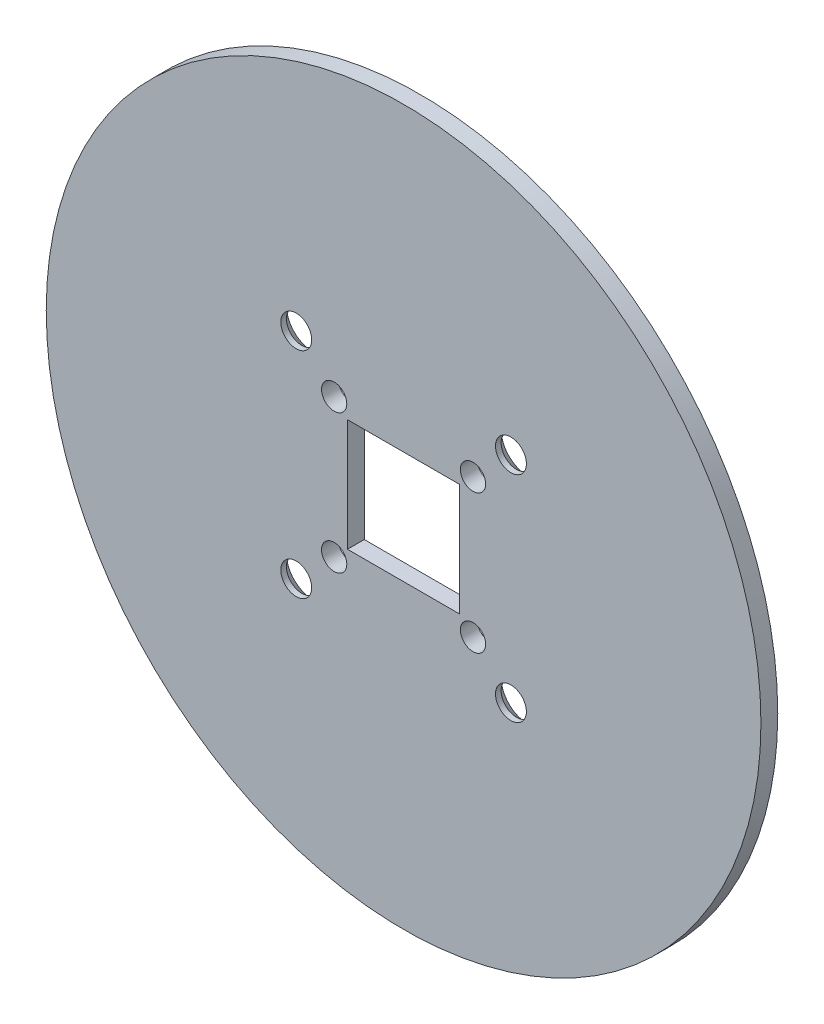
ISO-10303-21;
HEADER;
FILE_DESCRIPTION(('STEP AP214'),'2;1');
FILE_NAME('part.step','',(''),(''),'','','');
FILE_SCHEMA(('AUTOMOTIVE_DESIGN { 1 0 10303 214 1 1 1 1 }'));
ENDSEC;
DATA;
#1=APPLICATION_CONTEXT('core data for automotive mechanical design processes');
#2=APPLICATION_PROTOCOL_DEFINITION('international standard','automotive_design',2000,#1);
#3=PRODUCT_CONTEXT('',#1,'mechanical');
#4=PRODUCT('Part','Part','',(#3));
#5=PRODUCT_RELATED_PRODUCT_CATEGORY('part','',(#4));
#6=PRODUCT_DEFINITION_FORMATION('','',#4);
#7=PRODUCT_DEFINITION_CONTEXT('part definition',#1,'design');
#8=PRODUCT_DEFINITION('design','',#6,#7);
#9=PRODUCT_DEFINITION_SHAPE('','',#8);
#10=(LENGTH_UNIT() NAMED_UNIT(*) SI_UNIT(.MILLI.,.METRE.));
#11=(NAMED_UNIT(*) PLANE_ANGLE_UNIT() SI_UNIT($,.RADIAN.));
#12=(NAMED_UNIT(*) SI_UNIT($,.STERADIAN.) SOLID_ANGLE_UNIT());
#13=UNCERTAINTY_MEASURE_WITH_UNIT(LENGTH_MEASURE(1.E-05),#10,'distance_accuracy_value','');
#14=(GEOMETRIC_REPRESENTATION_CONTEXT(3) GLOBAL_UNCERTAINTY_ASSIGNED_CONTEXT((#13)) GLOBAL_UNIT_ASSIGNED_CONTEXT((#10,
#11,#12)) REPRESENTATION_CONTEXT('',''));
#15=CARTESIAN_POINT('',(0.,0.,0.));
#16=DIRECTION('',(0.,0.,1.));
#17=DIRECTION('',(1.,0.,0.));
#18=AXIS2_PLACEMENT_3D('',#15,#16,#17);
#19=CARTESIAN_POINT('',(-63.6939766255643,-63.6939766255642,3.));
#20=DIRECTION('',(0.,0.,1.));
#21=DIRECTION('',(1.,0.,0.));
#22=AXIS2_PLACEMENT_3D('',#19,#20,#21);
#23=PLANE('',#22);
#24=CARTESIAN_POINT('',(12.3743686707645,-12.3743686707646,3.));
#25=DIRECTION('',(0.,0.,1.));
#26=DIRECTION('',(1.,0.,0.));
#27=AXIS2_PLACEMENT_3D('',#24,#25,#26);
#28=CIRCLE('',#27,2.25);
#29=CARTESIAN_POINT('',(14.6243686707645,-12.3743686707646,3.));
#30=VERTEX_POINT('',#29);
#31=EDGE_CURVE('E170',#30,#30,#28,.T.);
#32=ORIENTED_EDGE('',*,*,#31,.F.);
#33=EDGE_LOOP('',(#32));
#34=FACE_BOUND('',#33,.T.);
#35=CARTESIAN_POINT('',(12.3743686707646,12.3743686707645,3.));
#36=DIRECTION('',(0.,0.,1.));
#37=DIRECTION('',(1.,0.,0.));
#38=AXIS2_PLACEMENT_3D('',#35,#36,#37);
#39=CIRCLE('',#38,2.25);
#40=CARTESIAN_POINT('',(14.6243686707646,12.3743686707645,3.));
#41=VERTEX_POINT('',#40);
#42=EDGE_CURVE('E176',#41,#41,#39,.T.);
#43=ORIENTED_EDGE('',*,*,#42,.F.);
#44=EDGE_LOOP('',(#43));
#45=FACE_BOUND('',#44,.T.);
#46=CARTESIAN_POINT('',(-12.3743686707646,-12.3743686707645,3.));
#47=DIRECTION('',(0.,0.,1.));
#48=DIRECTION('',(1.,0.,0.));
#49=AXIS2_PLACEMENT_3D('',#46,#47,#48);
#50=CIRCLE('',#49,2.25);
#51=CARTESIAN_POINT('',(-10.1243686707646,-12.3743686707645,3.));
#52=VERTEX_POINT('',#51);
#53=EDGE_CURVE('E182',#52,#52,#50,.T.);
#54=ORIENTED_EDGE('',*,*,#53,.F.);
#55=EDGE_LOOP('',(#54));
#56=FACE_BOUND('',#55,.T.);
#57=CARTESIAN_POINT('',(-12.3743686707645,12.3743686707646,3.));
#58=DIRECTION('',(0.,0.,1.));
#59=DIRECTION('',(1.,0.,0.));
#60=AXIS2_PLACEMENT_3D('',#57,#58,#59);
#61=CIRCLE('',#60,2.25);
#62=CARTESIAN_POINT('',(-10.1243686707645,12.3743686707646,3.));
#63=VERTEX_POINT('',#62);
#64=EDGE_CURVE('E188',#63,#63,#61,.T.);
#65=ORIENTED_EDGE('',*,*,#64,.F.);
#66=EDGE_LOOP('',(#65));
#67=FACE_BOUND('',#66,.T.);
#68=CARTESIAN_POINT('',(-19.1341716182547,-19.1341716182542,3.));
#69=DIRECTION('',(0.,0.,1.));
#70=DIRECTION('',(-1.,0.,0.));
#71=AXIS2_PLACEMENT_3D('',#68,#69,#70);
#72=CIRCLE('',#71,2.75);
#73=CARTESIAN_POINT('',(-21.8841716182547,-19.1341716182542,3.));
#74=VERTEX_POINT('',#73);
#75=EDGE_CURVE('E105',#74,#74,#72,.T.);
#76=ORIENTED_EDGE('',*,*,#75,.F.);
#77=EDGE_LOOP('',(#76));
#78=FACE_BOUND('',#77,.T.);
#79=CARTESIAN_POINT('',(19.1341716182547,-19.1341716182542,3.));
#80=DIRECTION('',(0.,0.,1.));
#81=DIRECTION('',(1.,0.,0.));
#82=AXIS2_PLACEMENT_3D('',#79,#80,#81);
#83=CIRCLE('',#82,2.75);
#84=CARTESIAN_POINT('',(21.8841716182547,-19.1341716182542,3.));
#85=VERTEX_POINT('',#84);
#86=EDGE_CURVE('E92',#85,#85,#83,.T.);
#87=ORIENTED_EDGE('',*,*,#86,.F.);
#88=EDGE_LOOP('',(#87));
#89=FACE_BOUND('',#88,.T.);
#90=CARTESIAN_POINT('',(19.1341716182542,19.1341716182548,3.));
#91=DIRECTION('',(0.,0.,1.));
#92=DIRECTION('',(1.,0.,0.));
#93=AXIS2_PLACEMENT_3D('',#90,#91,#92);
#94=CIRCLE('',#93,2.75);
#95=CARTESIAN_POINT('',(21.8841716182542,19.1341716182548,3.));
#96=VERTEX_POINT('',#95);
#97=EDGE_CURVE('E117',#96,#96,#94,.T.);
#98=ORIENTED_EDGE('',*,*,#97,.F.);
#99=EDGE_LOOP('',(#98));
#100=FACE_BOUND('',#99,.T.);
#101=DIRECTION('',(0.,1.,0.));
#102=VECTOR('',#101,1.);
#103=CARTESIAN_POINT('',(10.,10.,3.));
#104=LINE('',#103,#102);
#105=CARTESIAN_POINT('',(10.,-10.,3.));
#106=VERTEX_POINT('',#105);
#107=CARTESIAN_POINT('',(10.,10.,3.));
#108=VERTEX_POINT('',#107);
#109=EDGE_CURVE('E84',#106,#108,#104,.T.);
#110=ORIENTED_EDGE('',*,*,#109,.F.);
#111=DIRECTION('',(1.,0.,0.));
#112=VECTOR('',#111,1.);
#113=CARTESIAN_POINT('',(-9.99999999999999,-10.,3.));
#114=LINE('',#113,#112);
#115=CARTESIAN_POINT('',(-9.99999999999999,-10.,3.));
#116=VERTEX_POINT('',#115);
#117=EDGE_CURVE('E76',#116,#106,#114,.T.);
#118=ORIENTED_EDGE('',*,*,#117,.F.);
#119=DIRECTION('',(0.,-1.,0.));
#120=VECTOR('',#119,1.);
#121=CARTESIAN_POINT('',(-9.99999999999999,10.,3.));
#122=LINE('',#121,#120);
#123=CARTESIAN_POINT('',(-9.99999999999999,9.99999999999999,3.));
#124=VERTEX_POINT('',#123);
#125=EDGE_CURVE('E99',#124,#116,#122,.T.);
#126=ORIENTED_EDGE('',*,*,#125,.F.);
#127=DIRECTION('',(-1.,0.,0.));
#128=VECTOR('',#127,1.);
#129=CARTESIAN_POINT('',(-9.99999999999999,10.,3.));
#130=LINE('',#129,#128);
#131=EDGE_CURVE('E97',#108,#124,#130,.T.);
#132=ORIENTED_EDGE('',*,*,#131,.F.);
#133=EDGE_LOOP('',(#110,#118,#126,#132));
#134=FACE_BOUND('',#133,.T.);
#135=CARTESIAN_POINT('',(-19.1341716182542,19.1341716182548,3.));
#136=DIRECTION('',(0.,0.,1.));
#137=DIRECTION('',(-1.,0.,0.));
#138=AXIS2_PLACEMENT_3D('',#135,#136,#137);
#139=CIRCLE('',#138,2.75);
#140=CARTESIAN_POINT('',(-21.8841716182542,19.1341716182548,3.));
#141=VERTEX_POINT('',#140);
#142=EDGE_CURVE('E191',#141,#141,#139,.T.);
#143=ORIENTED_EDGE('',*,*,#142,.F.);
#144=EDGE_LOOP('',(#143));
#145=FACE_BOUND('',#144,.T.);
#146=CARTESIAN_POINT('',(0.,0.,3.));
#147=DIRECTION('',(0.,0.,1.));
#148=DIRECTION('',(1.,0.,0.));
#149=AXIS2_PLACEMENT_3D('',#146,#147,#148);
#150=CIRCLE('',#149,63.6939766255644);
#151=CARTESIAN_POINT('',(63.6939766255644,0.,3.));
#152=VERTEX_POINT('',#151);
#153=EDGE_CURVE('E162',#152,#152,#150,.T.);
#154=ORIENTED_EDGE('',*,*,#153,.T.);
#155=EDGE_LOOP('',(#154));
#156=FACE_BOUND('',#155,.T.);
#157=ADVANCED_FACE('F35',(#34,#45,#56,#67,#78,#89,#100,#134,#145,#156),#23,.T.);
#158=CARTESIAN_POINT('',(-63.6939766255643,-63.6939766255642,0.));
#159=DIRECTION('',(0.,0.,1.));
#160=DIRECTION('',(1.,0.,0.));
#161=AXIS2_PLACEMENT_3D('',#158,#159,#160);
#162=PLANE('',#161);
#163=CARTESIAN_POINT('',(12.3743686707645,-12.3743686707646,0.));
#164=DIRECTION('',(0.,0.,-1.));
#165=DIRECTION('',(-1.,0.,0.));
#166=AXIS2_PLACEMENT_3D('',#163,#164,#165);
#167=CIRCLE('',#166,2.25);
#168=CARTESIAN_POINT('',(10.1243686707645,-12.3743686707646,0.));
#169=VERTEX_POINT('',#168);
#170=EDGE_CURVE('E165',#169,#169,#167,.T.);
#171=ORIENTED_EDGE('',*,*,#170,.F.);
#172=EDGE_LOOP('',(#171));
#173=FACE_BOUND('',#172,.T.);
#174=CARTESIAN_POINT('',(12.3743686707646,12.3743686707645,0.));
#175=DIRECTION('',(0.,0.,-1.));
#176=DIRECTION('',(-1.,0.,0.));
#177=AXIS2_PLACEMENT_3D('',#174,#175,#176);
#178=CIRCLE('',#177,2.25);
#179=CARTESIAN_POINT('',(10.1243686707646,12.3743686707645,0.));
#180=VERTEX_POINT('',#179);
#181=EDGE_CURVE('E173',#180,#180,#178,.T.);
#182=ORIENTED_EDGE('',*,*,#181,.F.);
#183=EDGE_LOOP('',(#182));
#184=FACE_BOUND('',#183,.T.);
#185=CARTESIAN_POINT('',(-12.3743686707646,-12.3743686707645,0.));
#186=DIRECTION('',(0.,0.,-1.));
#187=DIRECTION('',(-1.,0.,0.));
#188=AXIS2_PLACEMENT_3D('',#185,#186,#187);
#189=CIRCLE('',#188,2.25);
#190=CARTESIAN_POINT('',(-14.6243686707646,-12.3743686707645,0.));
#191=VERTEX_POINT('',#190);
#192=EDGE_CURVE('E179',#191,#191,#189,.T.);
#193=ORIENTED_EDGE('',*,*,#192,.F.);
#194=EDGE_LOOP('',(#193));
#195=FACE_BOUND('',#194,.T.);
#196=CARTESIAN_POINT('',(-12.3743686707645,12.3743686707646,0.));
#197=DIRECTION('',(0.,0.,-1.));
#198=DIRECTION('',(-1.,0.,0.));
#199=AXIS2_PLACEMENT_3D('',#196,#197,#198);
#200=CIRCLE('',#199,2.25);
#201=CARTESIAN_POINT('',(-14.6243686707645,12.3743686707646,0.));
#202=VERTEX_POINT('',#201);
#203=EDGE_CURVE('E185',#202,#202,#200,.T.);
#204=ORIENTED_EDGE('',*,*,#203,.F.);
#205=EDGE_LOOP('',(#204));
#206=FACE_BOUND('',#205,.T.);
#207=CARTESIAN_POINT('',(19.1341716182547,-19.1341716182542,0.));
#208=DIRECTION('',(0.,0.,1.));
#209=DIRECTION('',(1.,0.,0.));
#210=AXIS2_PLACEMENT_3D('',#207,#208,#209);
#211=CIRCLE('',#210,4.74999999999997);
#212=CARTESIAN_POINT('',(23.8841716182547,-19.1341716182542,0.));
#213=VERTEX_POINT('',#212);
#214=EDGE_CURVE('E129',#213,#213,#211,.T.);
#215=ORIENTED_EDGE('',*,*,#214,.T.);
#216=EDGE_LOOP('',(#215));
#217=FACE_BOUND('',#216,.T.);
#218=CARTESIAN_POINT('',(-19.1341716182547,-19.1341716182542,0.));
#219=DIRECTION('',(0.,0.,1.));
#220=DIRECTION('',(1.,0.,0.));
#221=AXIS2_PLACEMENT_3D('',#218,#219,#220);
#222=CIRCLE('',#221,4.74999999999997);
#223=CARTESIAN_POINT('',(-14.3841716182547,-19.1341716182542,0.));
#224=VERTEX_POINT('',#223);
#225=EDGE_CURVE('E126',#224,#224,#222,.T.);
#226=ORIENTED_EDGE('',*,*,#225,.T.);
#227=EDGE_LOOP('',(#226));
#228=FACE_BOUND('',#227,.T.);
#229=CARTESIAN_POINT('',(-19.1341716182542,19.1341716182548,0.));
#230=DIRECTION('',(0.,0.,1.));
#231=DIRECTION('',(1.,0.,0.));
#232=AXIS2_PLACEMENT_3D('',#229,#230,#231);
#233=CIRCLE('',#232,4.74999999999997);
#234=CARTESIAN_POINT('',(-14.3841716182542,19.1341716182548,0.));
#235=VERTEX_POINT('',#234);
#236=EDGE_CURVE('E123',#235,#235,#233,.T.);
#237=ORIENTED_EDGE('',*,*,#236,.T.);
#238=EDGE_LOOP('',(#237));
#239=FACE_BOUND('',#238,.T.);
#240=CARTESIAN_POINT('',(19.1341716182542,19.1341716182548,0.));
#241=DIRECTION('',(0.,0.,1.));
#242=DIRECTION('',(1.,0.,0.));
#243=AXIS2_PLACEMENT_3D('',#240,#241,#242);
#244=CIRCLE('',#243,4.74999999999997);
#245=CARTESIAN_POINT('',(23.8841716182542,19.1341716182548,0.));
#246=VERTEX_POINT('',#245);
#247=EDGE_CURVE('E120',#246,#246,#244,.T.);
#248=ORIENTED_EDGE('',*,*,#247,.T.);
#249=EDGE_LOOP('',(#248));
#250=FACE_BOUND('',#249,.T.);
#251=DIRECTION('',(1.,0.,0.));
#252=VECTOR('',#251,1.);
#253=CARTESIAN_POINT('',(-9.99999999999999,-10.,0.));
#254=LINE('',#253,#252);
#255=CARTESIAN_POINT('',(-9.99999999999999,-9.99999999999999,0.));
#256=VERTEX_POINT('',#255);
#257=CARTESIAN_POINT('',(10.,-10.,0.));
#258=VERTEX_POINT('',#257);
#259=EDGE_CURVE('E58',#256,#258,#254,.T.);
#260=ORIENTED_EDGE('',*,*,#259,.T.);
#261=DIRECTION('',(0.,1.,0.));
#262=VECTOR('',#261,1.);
#263=CARTESIAN_POINT('',(10.,10.,0.));
#264=LINE('',#263,#262);
#265=CARTESIAN_POINT('',(10.,10.,0.));
#266=VERTEX_POINT('',#265);
#267=EDGE_CURVE('E91',#258,#266,#264,.T.);
#268=ORIENTED_EDGE('',*,*,#267,.T.);
#269=DIRECTION('',(-1.,0.,0.));
#270=VECTOR('',#269,1.);
#271=CARTESIAN_POINT('',(-9.99999999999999,10.,0.));
#272=LINE('',#271,#270);
#273=CARTESIAN_POINT('',(-9.99999999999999,10.,0.));
#274=VERTEX_POINT('',#273);
#275=EDGE_CURVE('E107',#266,#274,#272,.T.);
#276=ORIENTED_EDGE('',*,*,#275,.T.);
#277=DIRECTION('',(0.,-1.,0.));
#278=VECTOR('',#277,1.);
#279=CARTESIAN_POINT('',(-9.99999999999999,10.,0.));
#280=LINE('',#279,#278);
#281=EDGE_CURVE('E85',#274,#256,#280,.T.);
#282=ORIENTED_EDGE('',*,*,#281,.T.);
#283=EDGE_LOOP('',(#260,#268,#276,#282));
#284=FACE_BOUND('',#283,.T.);
#285=CARTESIAN_POINT('',(0.,0.,0.));
#286=DIRECTION('',(0.,0.,-1.));
#287=DIRECTION('',(-1.,0.,0.));
#288=AXIS2_PLACEMENT_3D('',#285,#286,#287);
#289=CIRCLE('',#288,63.6939766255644);
#290=CARTESIAN_POINT('',(-63.6939766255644,0.,0.));
#291=VERTEX_POINT('',#290);
#292=EDGE_CURVE('E160',#291,#291,#289,.T.);
#293=ORIENTED_EDGE('',*,*,#292,.T.);
#294=EDGE_LOOP('',(#293));
#295=FACE_BOUND('',#294,.T.);
#296=ADVANCED_FACE('F149',(#173,#184,#195,#206,#217,#228,#239,#250,#284,#295),#162,.F.);
#297=CARTESIAN_POINT('',(19.1341716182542,19.1341716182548,3.));
#298=DIRECTION('',(0.,0.,-1.));
#299=DIRECTION('',(-1.,0.,0.));
#300=AXIS2_PLACEMENT_3D('',#297,#298,#299);
#301=CYLINDRICAL_SURFACE('',#300,2.75);
#302=CARTESIAN_POINT('',(19.1341716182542,19.1341716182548,1.99999999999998));
#303=DIRECTION('',(0.,0.,1.));
#304=DIRECTION('',(1.,0.,0.));
#305=AXIS2_PLACEMENT_3D('',#302,#303,#304);
#306=CIRCLE('',#305,2.75);
#307=CARTESIAN_POINT('',(21.8841716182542,19.1341716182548,1.99999999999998));
#308=VERTEX_POINT('',#307);
#309=EDGE_CURVE('E12',#308,#308,#306,.F.);
#310=ORIENTED_EDGE('',*,*,#309,.T.);
#311=EDGE_LOOP('',(#310));
#312=FACE_BOUND('',#311,.T.);
#313=ORIENTED_EDGE('',*,*,#97,.T.);
#314=EDGE_LOOP('',(#313));
#315=FACE_BOUND('',#314,.T.);
#316=ADVANCED_FACE('F152',(#312,#315),#301,.F.);
#317=CARTESIAN_POINT('',(19.1341716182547,-19.1341716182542,3.));
#318=DIRECTION('',(0.,0.,-1.));
#319=DIRECTION('',(-1.,0.,0.));
#320=AXIS2_PLACEMENT_3D('',#317,#318,#319);
#321=CYLINDRICAL_SURFACE('',#320,2.75);
#322=CARTESIAN_POINT('',(19.1341716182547,-19.1341716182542,1.99999999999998));
#323=DIRECTION('',(0.,0.,1.));
#324=DIRECTION('',(1.,0.,0.));
#325=AXIS2_PLACEMENT_3D('',#322,#323,#324);
#326=CIRCLE('',#325,2.75);
#327=CARTESIAN_POINT('',(21.8841716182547,-19.1341716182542,1.99999999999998));
#328=VERTEX_POINT('',#327);
#329=EDGE_CURVE('E132',#328,#328,#326,.F.);
#330=ORIENTED_EDGE('',*,*,#329,.T.);
#331=EDGE_LOOP('',(#330));
#332=FACE_BOUND('',#331,.T.);
#333=ORIENTED_EDGE('',*,*,#86,.T.);
#334=EDGE_LOOP('',(#333));
#335=FACE_BOUND('',#334,.T.);
#336=ADVANCED_FACE('F207',(#332,#335),#321,.F.);
#337=CARTESIAN_POINT('',(-9.99999999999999,-10.,3.));
#338=DIRECTION('',(0.,1.,0.));
#339=DIRECTION('',(0.,0.,1.));
#340=AXIS2_PLACEMENT_3D('',#337,#338,#339);
#341=PLANE('',#340);
#342=ORIENTED_EDGE('',*,*,#259,.F.);
#343=DIRECTION('',(0.,0.,-1.));
#344=VECTOR('',#343,1.);
#345=CARTESIAN_POINT('',(-9.99999999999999,-10.,3.));
#346=LINE('',#345,#344);
#347=EDGE_CURVE('E80',#116,#256,#346,.T.);
#348=ORIENTED_EDGE('',*,*,#347,.F.);
#349=ORIENTED_EDGE('',*,*,#117,.T.);
#350=DIRECTION('',(0.,0.,-1.));
#351=VECTOR('',#350,1.);
#352=CARTESIAN_POINT('',(10.,-10.,3.));
#353=LINE('',#352,#351);
#354=EDGE_CURVE('E79',#106,#258,#353,.T.);
#355=ORIENTED_EDGE('',*,*,#354,.T.);
#356=EDGE_LOOP('',(#342,#348,#349,#355));
#357=FACE_BOUND('',#356,.T.);
#358=ADVANCED_FACE('F78',(#357),#341,.T.);
#359=CARTESIAN_POINT('',(10.,10.,3.));
#360=DIRECTION('',(-1.,0.,0.));
#361=DIRECTION('',(0.,-1.,0.));
#362=AXIS2_PLACEMENT_3D('',#359,#360,#361);
#363=PLANE('',#362);
#364=ORIENTED_EDGE('',*,*,#267,.F.);
#365=ORIENTED_EDGE('',*,*,#354,.F.);
#366=ORIENTED_EDGE('',*,*,#109,.T.);
#367=DIRECTION('',(0.,0.,-1.));
#368=VECTOR('',#367,1.);
#369=CARTESIAN_POINT('',(10.,10.,3.));
#370=LINE('',#369,#368);
#371=EDGE_CURVE('E93',#108,#266,#370,.T.);
#372=ORIENTED_EDGE('',*,*,#371,.T.);
#373=EDGE_LOOP('',(#364,#365,#366,#372));
#374=FACE_BOUND('',#373,.T.);
#375=ADVANCED_FACE('F88',(#374),#363,.T.);
#376=CARTESIAN_POINT('',(-9.99999999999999,10.,3.));
#377=DIRECTION('',(0.,-1.,0.));
#378=DIRECTION('',(0.,0.,-1.));
#379=AXIS2_PLACEMENT_3D('',#376,#377,#378);
#380=PLANE('',#379);
#381=ORIENTED_EDGE('',*,*,#275,.F.);
#382=ORIENTED_EDGE('',*,*,#371,.F.);
#383=ORIENTED_EDGE('',*,*,#131,.T.);
#384=DIRECTION('',(0.,0.,-1.));
#385=VECTOR('',#384,1.);
#386=CARTESIAN_POINT('',(-9.99999999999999,10.,3.));
#387=LINE('',#386,#385);
#388=EDGE_CURVE('E50',#124,#274,#387,.T.);
#389=ORIENTED_EDGE('',*,*,#388,.T.);
#390=EDGE_LOOP('',(#381,#382,#383,#389));
#391=FACE_BOUND('',#390,.T.);
#392=ADVANCED_FACE('F238',(#391),#380,.T.);
#393=CARTESIAN_POINT('',(-9.99999999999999,10.,3.));
#394=DIRECTION('',(1.,0.,0.));
#395=DIRECTION('',(0.,0.,-1.));
#396=AXIS2_PLACEMENT_3D('',#393,#394,#395);
#397=PLANE('',#396);
#398=ORIENTED_EDGE('',*,*,#281,.F.);
#399=ORIENTED_EDGE('',*,*,#388,.F.);
#400=ORIENTED_EDGE('',*,*,#125,.T.);
#401=ORIENTED_EDGE('',*,*,#347,.T.);
#402=EDGE_LOOP('',(#398,#399,#400,#401));
#403=FACE_BOUND('',#402,.T.);
#404=ADVANCED_FACE('F231',(#403),#397,.T.);
#405=CARTESIAN_POINT('',(-19.1341716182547,-19.1341716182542,3.));
#406=DIRECTION('',(0.,0.,-1.));
#407=DIRECTION('',(-1.,0.,0.));
#408=AXIS2_PLACEMENT_3D('',#405,#406,#407);
#409=CYLINDRICAL_SURFACE('',#408,2.75);
#410=CARTESIAN_POINT('',(-19.1341716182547,-19.1341716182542,1.99999999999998));
#411=DIRECTION('',(0.,0.,1.));
#412=DIRECTION('',(1.,0.,0.));
#413=AXIS2_PLACEMENT_3D('',#410,#411,#412);
#414=CIRCLE('',#413,2.75);
#415=CARTESIAN_POINT('',(-16.3841716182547,-19.1341716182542,1.99999999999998));
#416=VERTEX_POINT('',#415);
#417=EDGE_CURVE('E135',#416,#416,#414,.F.);
#418=ORIENTED_EDGE('',*,*,#417,.T.);
#419=EDGE_LOOP('',(#418));
#420=FACE_BOUND('',#419,.T.);
#421=ORIENTED_EDGE('',*,*,#75,.T.);
#422=EDGE_LOOP('',(#421));
#423=FACE_BOUND('',#422,.T.);
#424=ADVANCED_FACE('F196',(#420,#423),#409,.F.);
#425=CARTESIAN_POINT('',(-19.1341716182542,19.1341716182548,3.));
#426=DIRECTION('',(0.,0.,-1.));
#427=DIRECTION('',(-1.,0.,0.));
#428=AXIS2_PLACEMENT_3D('',#425,#426,#427);
#429=CYLINDRICAL_SURFACE('',#428,2.75);
#430=CARTESIAN_POINT('',(-19.1341716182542,19.1341716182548,1.99999999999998));
#431=DIRECTION('',(0.,0.,1.));
#432=DIRECTION('',(1.,0.,0.));
#433=AXIS2_PLACEMENT_3D('',#430,#431,#432);
#434=CIRCLE('',#433,2.75);
#435=CARTESIAN_POINT('',(-16.3841716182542,19.1341716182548,1.99999999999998));
#436=VERTEX_POINT('',#435);
#437=EDGE_CURVE('E43',#436,#436,#434,.F.);
#438=ORIENTED_EDGE('',*,*,#437,.T.);
#439=EDGE_LOOP('',(#438));
#440=FACE_BOUND('',#439,.T.);
#441=ORIENTED_EDGE('',*,*,#142,.T.);
#442=EDGE_LOOP('',(#441));
#443=FACE_BOUND('',#442,.T.);
#444=ADVANCED_FACE('F140',(#440,#443),#429,.F.);
#445=CARTESIAN_POINT('',(19.1341716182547,-19.1341716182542,0.));
#446=DIRECTION('',(0.,0.,-1.));
#447=DIRECTION('',(-1.,0.,0.));
#448=AXIS2_PLACEMENT_3D('',#445,#446,#447);
#449=CONICAL_SURFACE('',#448,4.74999999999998,0.785398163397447);
#450=ORIENTED_EDGE('',*,*,#329,.F.);
#451=EDGE_LOOP('',(#450));
#452=FACE_BOUND('',#451,.T.);
#453=ORIENTED_EDGE('',*,*,#214,.F.);
#454=EDGE_LOOP('',(#453));
#455=FACE_BOUND('',#454,.T.);
#456=ADVANCED_FACE('F217',(#452,#455),#449,.F.);
#457=CARTESIAN_POINT('',(-19.1341716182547,-19.1341716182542,0.));
#458=DIRECTION('',(0.,0.,-1.));
#459=DIRECTION('',(-1.,0.,0.));
#460=AXIS2_PLACEMENT_3D('',#457,#458,#459);
#461=CONICAL_SURFACE('',#460,4.74999999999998,0.785398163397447);
#462=ORIENTED_EDGE('',*,*,#417,.F.);
#463=EDGE_LOOP('',(#462));
#464=FACE_BOUND('',#463,.T.);
#465=ORIENTED_EDGE('',*,*,#225,.F.);
#466=EDGE_LOOP('',(#465));
#467=FACE_BOUND('',#466,.T.);
#468=ADVANCED_FACE('F146',(#464,#467),#461,.F.);
#469=CARTESIAN_POINT('',(-19.1341716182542,19.1341716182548,0.));
#470=DIRECTION('',(0.,0.,-1.));
#471=DIRECTION('',(-1.,0.,0.));
#472=AXIS2_PLACEMENT_3D('',#469,#470,#471);
#473=CONICAL_SURFACE('',#472,4.74999999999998,0.785398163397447);
#474=ORIENTED_EDGE('',*,*,#437,.F.);
#475=EDGE_LOOP('',(#474));
#476=FACE_BOUND('',#475,.T.);
#477=ORIENTED_EDGE('',*,*,#236,.F.);
#478=EDGE_LOOP('',(#477));
#479=FACE_BOUND('',#478,.T.);
#480=ADVANCED_FACE('F143',(#476,#479),#473,.F.);
#481=CARTESIAN_POINT('',(19.1341716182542,19.1341716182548,0.));
#482=DIRECTION('',(0.,0.,-1.));
#483=DIRECTION('',(-1.,0.,0.));
#484=AXIS2_PLACEMENT_3D('',#481,#482,#483);
#485=CONICAL_SURFACE('',#484,4.74999999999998,0.785398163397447);
#486=ORIENTED_EDGE('',*,*,#309,.F.);
#487=EDGE_LOOP('',(#486));
#488=FACE_BOUND('',#487,.T.);
#489=ORIENTED_EDGE('',*,*,#247,.F.);
#490=EDGE_LOOP('',(#489));
#491=FACE_BOUND('',#490,.T.);
#492=ADVANCED_FACE('F37',(#488,#491),#485,.F.);
#493=CARTESIAN_POINT('',(-12.3743686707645,12.3743686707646,10.));
#494=DIRECTION('',(0.,0.,-1.));
#495=DIRECTION('',(-1.,0.,0.));
#496=AXIS2_PLACEMENT_3D('',#493,#494,#495);
#497=CYLINDRICAL_SURFACE('',#496,2.25);
#498=ORIENTED_EDGE('',*,*,#64,.T.);
#499=EDGE_LOOP('',(#498));
#500=FACE_BOUND('',#499,.T.);
#501=ORIENTED_EDGE('',*,*,#203,.T.);
#502=EDGE_LOOP('',(#501));
#503=FACE_BOUND('',#502,.T.);
#504=ADVANCED_FACE('F306',(#500,#503),#497,.F.);
#505=CARTESIAN_POINT('',(-12.3743686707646,-12.3743686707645,10.));
#506=DIRECTION('',(0.,0.,-1.));
#507=DIRECTION('',(-1.,0.,0.));
#508=AXIS2_PLACEMENT_3D('',#505,#506,#507);
#509=CYLINDRICAL_SURFACE('',#508,2.25);
#510=ORIENTED_EDGE('',*,*,#53,.T.);
#511=EDGE_LOOP('',(#510));
#512=FACE_BOUND('',#511,.T.);
#513=ORIENTED_EDGE('',*,*,#192,.T.);
#514=EDGE_LOOP('',(#513));
#515=FACE_BOUND('',#514,.T.);
#516=ADVANCED_FACE('F315',(#512,#515),#509,.F.);
#517=CARTESIAN_POINT('',(12.3743686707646,12.3743686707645,10.));
#518=DIRECTION('',(0.,0.,-1.));
#519=DIRECTION('',(-1.,0.,0.));
#520=AXIS2_PLACEMENT_3D('',#517,#518,#519);
#521=CYLINDRICAL_SURFACE('',#520,2.25);
#522=ORIENTED_EDGE('',*,*,#42,.T.);
#523=EDGE_LOOP('',(#522));
#524=FACE_BOUND('',#523,.T.);
#525=ORIENTED_EDGE('',*,*,#181,.T.);
#526=EDGE_LOOP('',(#525));
#527=FACE_BOUND('',#526,.T.);
#528=ADVANCED_FACE('F324',(#524,#527),#521,.F.);
#529=CARTESIAN_POINT('',(12.3743686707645,-12.3743686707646,10.));
#530=DIRECTION('',(0.,0.,-1.));
#531=DIRECTION('',(-1.,0.,0.));
#532=AXIS2_PLACEMENT_3D('',#529,#530,#531);
#533=CYLINDRICAL_SURFACE('',#532,2.25);
#534=ORIENTED_EDGE('',*,*,#31,.T.);
#535=EDGE_LOOP('',(#534));
#536=FACE_BOUND('',#535,.T.);
#537=ORIENTED_EDGE('',*,*,#170,.T.);
#538=EDGE_LOOP('',(#537));
#539=FACE_BOUND('',#538,.T.);
#540=ADVANCED_FACE('F334',(#536,#539),#533,.F.);
#541=CARTESIAN_POINT('',(0.,0.,10.));
#542=DIRECTION('',(0.,0.,-1.));
#543=DIRECTION('',(-1.,0.,0.));
#544=AXIS2_PLACEMENT_3D('',#541,#542,#543);
#545=CYLINDRICAL_SURFACE('',#544,63.6939766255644);
#546=ORIENTED_EDGE('',*,*,#292,.F.);
#547=EDGE_LOOP('',(#546));
#548=FACE_BOUND('',#547,.T.);
#549=ORIENTED_EDGE('',*,*,#153,.F.);
#550=EDGE_LOOP('',(#549));
#551=FACE_BOUND('',#550,.T.);
#552=ADVANCED_FACE('F344',(#548,#551),#545,.T.);
#553=CLOSED_SHELL('',(#157,#296,#316,#336,#358,#375,#392,#404,#424,#444,#456,#468,#480,#492,
#504,#516,#528,#540,#552));
#554=MANIFOLD_SOLID_BREP('B2',#553);
#555=ADVANCED_BREP_SHAPE_REPRESENTATION('',(#18,#554),#14);
#556=SHAPE_DEFINITION_REPRESENTATION(#9,#555);
ENDSEC;
END-ISO-10303-21;
